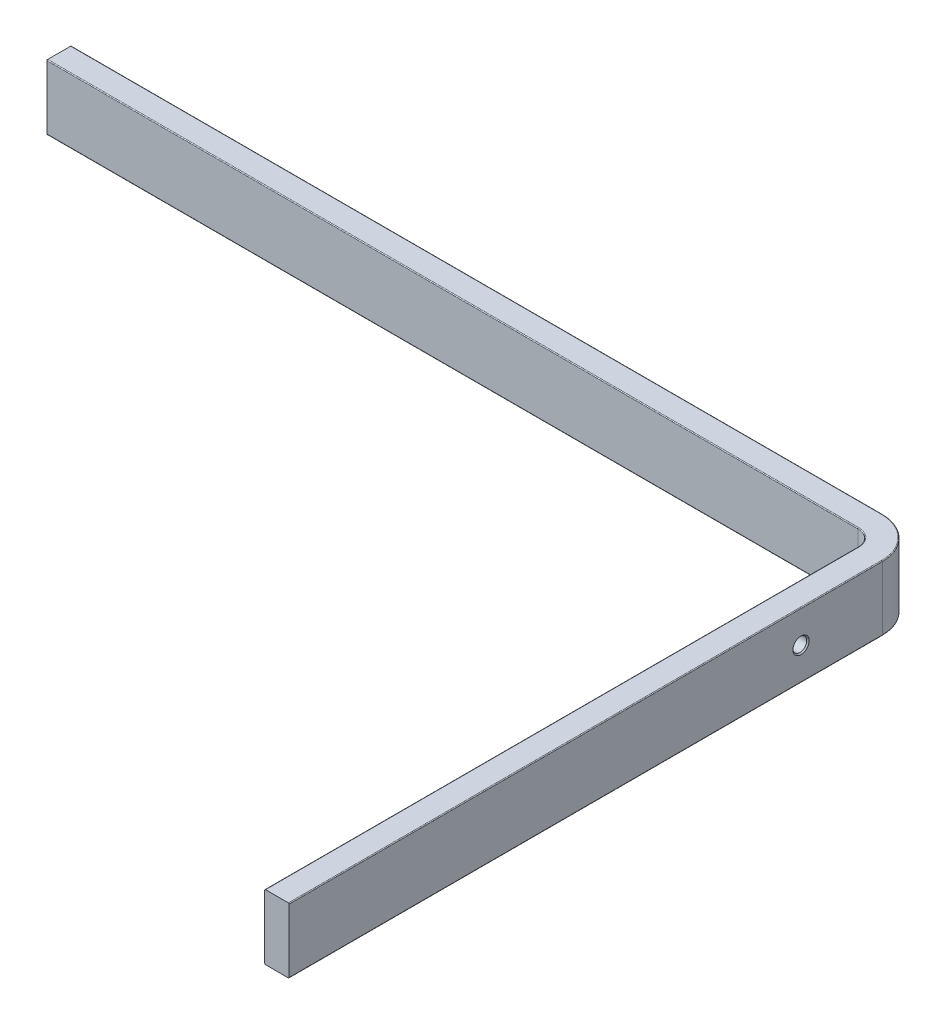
from build123d import *

# Parameters (mm, degrees)
ESQUISSE1_W                     = 525
ESQUISSE1_H                     = 390
BOSS_EXTRU_1_DEPTH              = 40
ESQUISSE2_W                     = 510
ESQUISSE2_H                     = 375
ENL_V_MAT_EXTRU_1_DEPTH         = 656.228967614
DIAM_TRE_DU_PER_AGE_8_5_8_5_1_D = 8.5
CONG_1_R                        = 10
CONG_2_R                        = 25
CHANFREIN1_SIZE                 = 1
CHANFREIN2_SIZE                 = 0.75
CONG_3_R                        = 0.5


with BuildPart() as part:
    # Esquisse1 → Boss.-Extru.1 (new body)
    with BuildSketch(Plane(origin=(0, 20, 0), x_dir=(1, 0, 0), z_dir=(0, 1, 0))):
        with Locations((-262.5, -195)):
            Rectangle(ESQUISSE1_W, ESQUISSE1_H)
    extrude(amount=-BOSS_EXTRU_1_DEPTH)

    # Esquisse2 → Enl_v. mat.-Extru.1 (cut, through all)
    with BuildSketch(Plane.XZ.offset(20)):
        with Locations((-270, 202.5)):
            Rectangle(ESQUISSE2_W, ESQUISSE2_H)
    extrude(amount=-ENL_V_MAT_EXTRU_1_DEPTH, mode=Mode.SUBTRACT)

    # Diam_tre du per_age _8.5 _8.5_1 (through all)
    with Locations(Plane.ZY.offset(15)):
        with Locations((75, 0)):
            Hole(DIAM_TRE_DU_PER_AGE_8_5_8_5_1_D / 2)

    # Cong_1
    cong_1_edges = [part.edges().sort_by_distance(p)[0] for p in [
        (-15, 0, 15),
    ]]
    fillet(cong_1_edges, radius=CONG_1_R)

    # Cong_2
    cong_2_edges = [part.edges().sort_by_distance(p)[0] for p in [
        (0, 0, 0),
    ]]
    fillet(cong_2_edges, radius=CONG_2_R)

    # Chanfrein1
    chanfrein1_edges = [part.edges().sort_by_distance(p)[0] for p in [
        (-525, -20, 7.5),
        (-525, 0, 15),
        (-525, 20, 7.5),
        (-525, 0, 0),
    ]]
    chamfer(chanfrein1_edges, length=CHANFREIN1_SIZE)

    # Chanfrein2
    chanfrein2_edges = [part.edges().sort_by_distance(p)[0] for p in [
        (-15, 0, 79.25),
        (0, 0, 79.25),
    ]]
    chamfer(chanfrein2_edges, length=CHANFREIN2_SIZE)

    # Cong_3
    cong_3_edges = [part.edges().sort_by_distance(p)[0] for p in [
        (-15, -20, 207.5),
        (-15, 20, 207.5),
        (-17.928932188, -20, 17.928932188),
        (-17.928932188, 20, 17.928932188),
        (-274.5, 20, 0),
        (0, -20, 207.5),
        (-7.32233047, 20, 7.32233047),
        (-274.5, -20, 0),
        (-7.32233047, -20, 7.32233047),
        (-274.5, 20, 15),
        (-274.5, -20, 15),
        (0, 20, 207.5),
    ]]
    fillet(cong_3_edges, radius=CONG_3_R)


solid = part.part
